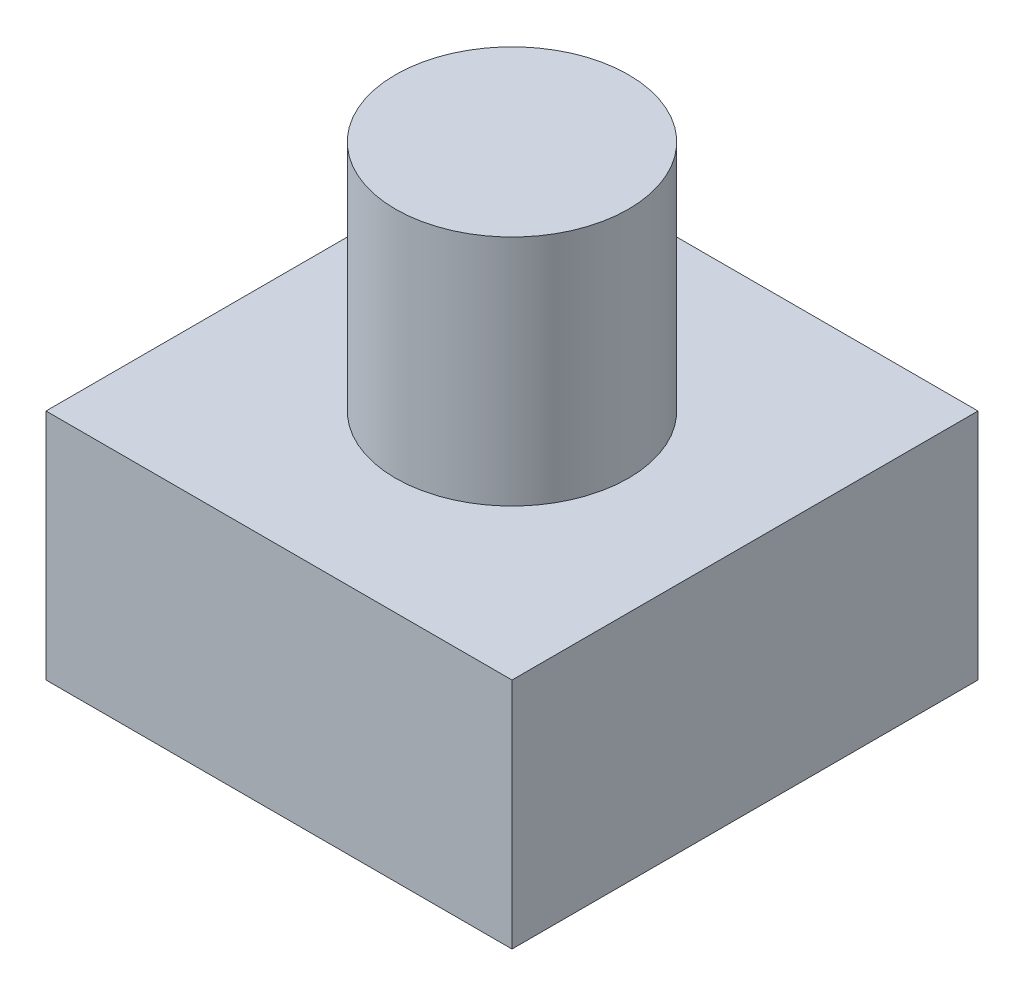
ISO-10303-21;
HEADER;
FILE_DESCRIPTION(('STEP AP214'),'2;1');
FILE_NAME('part.step','',(''),(''),'','','');
FILE_SCHEMA(('AUTOMOTIVE_DESIGN { 1 0 10303 214 1 1 1 1 }'));
ENDSEC;
DATA;
#1=APPLICATION_CONTEXT('core data for automotive mechanical design processes');
#2=APPLICATION_PROTOCOL_DEFINITION('international standard','automotive_design',2000,#1);
#3=PRODUCT_CONTEXT('',#1,'mechanical');
#4=PRODUCT('Part','Part','',(#3));
#5=PRODUCT_RELATED_PRODUCT_CATEGORY('part','',(#4));
#6=PRODUCT_DEFINITION_FORMATION('','',#4);
#7=PRODUCT_DEFINITION_CONTEXT('part definition',#1,'design');
#8=PRODUCT_DEFINITION('design','',#6,#7);
#9=PRODUCT_DEFINITION_SHAPE('','',#8);
#10=(LENGTH_UNIT() NAMED_UNIT(*) SI_UNIT(.MILLI.,.METRE.));
#11=(NAMED_UNIT(*) PLANE_ANGLE_UNIT() SI_UNIT($,.RADIAN.));
#12=(NAMED_UNIT(*) SI_UNIT($,.STERADIAN.) SOLID_ANGLE_UNIT());
#13=UNCERTAINTY_MEASURE_WITH_UNIT(LENGTH_MEASURE(1.E-05),#10,'distance_accuracy_value','');
#14=(GEOMETRIC_REPRESENTATION_CONTEXT(3) GLOBAL_UNCERTAINTY_ASSIGNED_CONTEXT((#13)) GLOBAL_UNIT_ASSIGNED_CONTEXT((#10,
#11,#12)) REPRESENTATION_CONTEXT('',''));
#15=CARTESIAN_POINT('',(0.,0.,0.));
#16=DIRECTION('',(0.,0.,1.));
#17=DIRECTION('',(1.,0.,0.));
#18=AXIS2_PLACEMENT_3D('',#15,#16,#17);
#19=CARTESIAN_POINT('',(0.,50.,0.));
#20=DIRECTION('',(0.,1.,0.));
#21=DIRECTION('',(0.,0.,1.));
#22=AXIS2_PLACEMENT_3D('',#19,#20,#21);
#23=PLANE('',#22);
#24=DIRECTION('',(0.,0.,-1.));
#25=VECTOR('',#24,1.);
#26=CARTESIAN_POINT('',(0.,50.,0.));
#27=LINE('',#26,#25);
#28=CARTESIAN_POINT('',(0.,50.,0.));
#29=VERTEX_POINT('',#28);
#30=CARTESIAN_POINT('',(0.,50.,-100.));
#31=VERTEX_POINT('',#30);
#32=EDGE_CURVE('E101',#29,#31,#27,.T.);
#33=ORIENTED_EDGE('',*,*,#32,.T.);
#34=DIRECTION('',(-1.,0.,0.));
#35=VECTOR('',#34,1.);
#36=CARTESIAN_POINT('',(0.,50.,-100.));
#37=LINE('',#36,#35);
#38=CARTESIAN_POINT('',(-100.,50.,-100.));
#39=VERTEX_POINT('',#38);
#40=EDGE_CURVE('E86',#31,#39,#37,.T.);
#41=ORIENTED_EDGE('',*,*,#40,.T.);
#42=DIRECTION('',(0.,0.,1.));
#43=VECTOR('',#42,1.);
#44=CARTESIAN_POINT('',(-100.,50.,0.));
#45=LINE('',#44,#43);
#46=CARTESIAN_POINT('',(-100.,50.,0.));
#47=VERTEX_POINT('',#46);
#48=EDGE_CURVE('E53',#39,#47,#45,.T.);
#49=ORIENTED_EDGE('',*,*,#48,.T.);
#50=DIRECTION('',(1.,0.,0.));
#51=VECTOR('',#50,1.);
#52=CARTESIAN_POINT('',(0.,50.,0.));
#53=LINE('',#52,#51);
#54=EDGE_CURVE('E48',#47,#29,#53,.T.);
#55=ORIENTED_EDGE('',*,*,#54,.T.);
#56=EDGE_LOOP('',(#33,#41,#49,#55));
#57=FACE_BOUND('',#56,.T.);
#58=CARTESIAN_POINT('',(-50.,50.,-50.));
#59=DIRECTION('',(0.,1.,0.));
#60=DIRECTION('',(0.,0.,1.));
#61=AXIS2_PLACEMENT_3D('',#58,#59,#60);
#62=CIRCLE('',#61,25.);
#63=CARTESIAN_POINT('',(-50.,50.,-25.));
#64=VERTEX_POINT('',#63);
#65=EDGE_CURVE('E94',#64,#64,#62,.T.);
#66=ORIENTED_EDGE('',*,*,#65,.F.);
#67=EDGE_LOOP('',(#66));
#68=FACE_BOUND('',#67,.T.);
#69=ADVANCED_FACE('F33',(#57,#68),#23,.T.);
#70=CARTESIAN_POINT('',(0.,50.,0.));
#71=DIRECTION('',(-1.,0.,0.));
#72=DIRECTION('',(0.,0.,1.));
#73=AXIS2_PLACEMENT_3D('',#70,#71,#72);
#74=PLANE('',#73);
#75=DIRECTION('',(0.,0.,-1.));
#76=VECTOR('',#75,1.);
#77=CARTESIAN_POINT('',(0.,0.,0.));
#78=LINE('',#77,#76);
#79=CARTESIAN_POINT('',(0.,0.,0.));
#80=VERTEX_POINT('',#79);
#81=CARTESIAN_POINT('',(0.,0.,-100.));
#82=VERTEX_POINT('',#81);
#83=EDGE_CURVE('E78',#80,#82,#78,.T.);
#84=ORIENTED_EDGE('',*,*,#83,.T.);
#85=DIRECTION('',(0.,-1.,0.));
#86=VECTOR('',#85,1.);
#87=CARTESIAN_POINT('',(0.,50.,-100.));
#88=LINE('',#87,#86);
#89=EDGE_CURVE('E11',#31,#82,#88,.T.);
#90=ORIENTED_EDGE('',*,*,#89,.F.);
#91=ORIENTED_EDGE('',*,*,#32,.F.);
#92=DIRECTION('',(0.,-1.,0.));
#93=VECTOR('',#92,1.);
#94=CARTESIAN_POINT('',(0.,50.,0.));
#95=LINE('',#94,#93);
#96=EDGE_CURVE('E90',#29,#80,#95,.T.);
#97=ORIENTED_EDGE('',*,*,#96,.T.);
#98=EDGE_LOOP('',(#84,#90,#91,#97));
#99=FACE_BOUND('',#98,.T.);
#100=ADVANCED_FACE('F35',(#99),#74,.F.);
#101=CARTESIAN_POINT('',(0.,50.,-100.));
#102=DIRECTION('',(0.,0.,1.));
#103=DIRECTION('',(1.,0.,0.));
#104=AXIS2_PLACEMENT_3D('',#101,#102,#103);
#105=PLANE('',#104);
#106=DIRECTION('',(-1.,0.,0.));
#107=VECTOR('',#106,1.);
#108=CARTESIAN_POINT('',(0.,0.,-100.));
#109=LINE('',#108,#107);
#110=CARTESIAN_POINT('',(-100.,0.,-100.));
#111=VERTEX_POINT('',#110);
#112=EDGE_CURVE('E74',#82,#111,#109,.T.);
#113=ORIENTED_EDGE('',*,*,#112,.T.);
#114=DIRECTION('',(0.,-1.,0.));
#115=VECTOR('',#114,1.);
#116=CARTESIAN_POINT('',(-100.,50.,-100.));
#117=LINE('',#116,#115);
#118=EDGE_CURVE('E41',#39,#111,#117,.T.);
#119=ORIENTED_EDGE('',*,*,#118,.F.);
#120=ORIENTED_EDGE('',*,*,#40,.F.);
#121=ORIENTED_EDGE('',*,*,#89,.T.);
#122=EDGE_LOOP('',(#113,#119,#120,#121));
#123=FACE_BOUND('',#122,.T.);
#124=ADVANCED_FACE('F85',(#123),#105,.F.);
#125=CARTESIAN_POINT('',(-100.,50.,0.));
#126=DIRECTION('',(1.,0.,0.));
#127=DIRECTION('',(0.,0.,-1.));
#128=AXIS2_PLACEMENT_3D('',#125,#126,#127);
#129=PLANE('',#128);
#130=DIRECTION('',(0.,0.,1.));
#131=VECTOR('',#130,1.);
#132=CARTESIAN_POINT('',(-100.,0.,0.));
#133=LINE('',#132,#131);
#134=CARTESIAN_POINT('',(-100.,0.,0.));
#135=VERTEX_POINT('',#134);
#136=EDGE_CURVE('E79',#111,#135,#133,.T.);
#137=ORIENTED_EDGE('',*,*,#136,.T.);
#138=DIRECTION('',(0.,-1.,0.));
#139=VECTOR('',#138,1.);
#140=CARTESIAN_POINT('',(-100.,50.,0.));
#141=LINE('',#140,#139);
#142=EDGE_CURVE('E107',#47,#135,#141,.T.);
#143=ORIENTED_EDGE('',*,*,#142,.F.);
#144=ORIENTED_EDGE('',*,*,#48,.F.);
#145=ORIENTED_EDGE('',*,*,#118,.T.);
#146=EDGE_LOOP('',(#137,#143,#144,#145));
#147=FACE_BOUND('',#146,.T.);
#148=ADVANCED_FACE('F110',(#147),#129,.F.);
#149=CARTESIAN_POINT('',(0.,50.,0.));
#150=DIRECTION('',(0.,0.,-1.));
#151=DIRECTION('',(-1.,0.,0.));
#152=AXIS2_PLACEMENT_3D('',#149,#150,#151);
#153=PLANE('',#152);
#154=DIRECTION('',(1.,0.,0.));
#155=VECTOR('',#154,1.);
#156=CARTESIAN_POINT('',(0.,0.,0.));
#157=LINE('',#156,#155);
#158=EDGE_CURVE('E99',#135,#80,#157,.T.);
#159=ORIENTED_EDGE('',*,*,#158,.T.);
#160=ORIENTED_EDGE('',*,*,#96,.F.);
#161=ORIENTED_EDGE('',*,*,#54,.F.);
#162=ORIENTED_EDGE('',*,*,#142,.T.);
#163=EDGE_LOOP('',(#159,#160,#161,#162));
#164=FACE_BOUND('',#163,.T.);
#165=ADVANCED_FACE('F112',(#164),#153,.F.);
#166=CARTESIAN_POINT('',(0.,0.,0.));
#167=DIRECTION('',(0.,1.,0.));
#168=DIRECTION('',(0.,0.,1.));
#169=AXIS2_PLACEMENT_3D('',#166,#167,#168);
#170=PLANE('',#169);
#171=ORIENTED_EDGE('',*,*,#83,.F.);
#172=ORIENTED_EDGE('',*,*,#158,.F.);
#173=ORIENTED_EDGE('',*,*,#136,.F.);
#174=ORIENTED_EDGE('',*,*,#112,.F.);
#175=EDGE_LOOP('',(#171,#172,#173,#174));
#176=FACE_BOUND('',#175,.T.);
#177=ADVANCED_FACE('F75',(#176),#170,.F.);
#178=CARTESIAN_POINT('',(-50.,100.,-50.));
#179=DIRECTION('',(0.,-1.,0.));
#180=DIRECTION('',(0.,0.,-1.));
#181=AXIS2_PLACEMENT_3D('',#178,#179,#180);
#182=CYLINDRICAL_SURFACE('',#181,25.);
#183=CARTESIAN_POINT('',(-50.,100.,-50.));
#184=DIRECTION('',(0.,1.,0.));
#185=DIRECTION('',(0.,0.,1.));
#186=AXIS2_PLACEMENT_3D('',#183,#184,#185);
#187=CIRCLE('',#186,25.);
#188=CARTESIAN_POINT('',(-50.,100.,-25.));
#189=VERTEX_POINT('',#188);
#190=EDGE_CURVE('E91',#189,#189,#187,.T.);
#191=ORIENTED_EDGE('',*,*,#190,.F.);
#192=EDGE_LOOP('',(#191));
#193=FACE_BOUND('',#192,.T.);
#194=ORIENTED_EDGE('',*,*,#65,.T.);
#195=EDGE_LOOP('',(#194));
#196=FACE_BOUND('',#195,.T.);
#197=ADVANCED_FACE('F119',(#193,#196),#182,.T.);
#198=CARTESIAN_POINT('',(-50.,100.,-50.));
#199=DIRECTION('',(0.,1.,0.));
#200=DIRECTION('',(0.,0.,1.));
#201=AXIS2_PLACEMENT_3D('',#198,#199,#200);
#202=PLANE('',#201);
#203=ORIENTED_EDGE('',*,*,#190,.T.);
#204=EDGE_LOOP('',(#203));
#205=FACE_BOUND('',#204,.T.);
#206=ADVANCED_FACE('F121',(#205),#202,.T.);
#207=CLOSED_SHELL('',(#69,#100,#124,#148,#165,#177,#197,#206));
#208=MANIFOLD_SOLID_BREP('B2',#207);
#209=ADVANCED_BREP_SHAPE_REPRESENTATION('',(#18,#208),#14);
#210=SHAPE_DEFINITION_REPRESENTATION(#9,#209);
ENDSEC;
END-ISO-10303-21;
